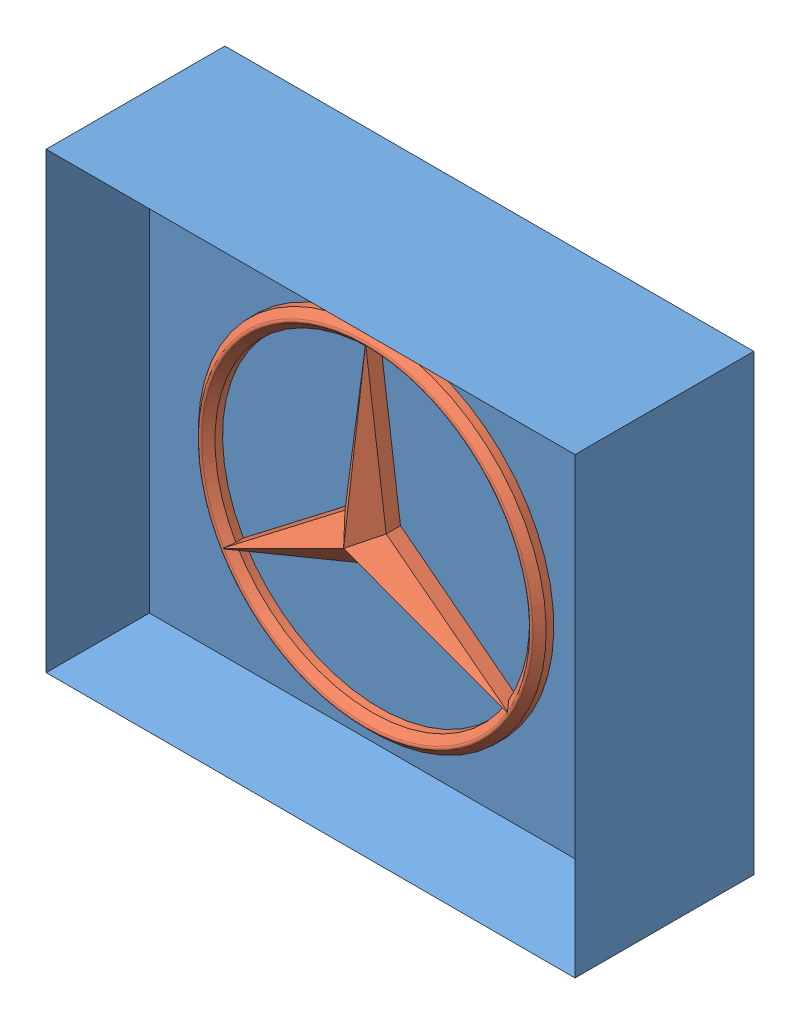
SolidWorks assembly moldassembly.SLDASM, configuration Default (file format 9000). Lengths in mm.
Overall size (88.9 76.2 30.05).
2 component instances, 2 part files, 1 mates.
Components (placement in the parent):
- box-1: box.SLDPRT [Default] at origin size (88.9 76.2 30.05)
- mercedes - Copy-1: mercedes - Copy.SLDPRT [Default] at (0.6414 -4.9482 -0.3731) size (58.49 58.49 6.1)
Mates (geometry in assembly coordinates):
- Coincident1: coincident: plane of box-1 through (0 0 0) normal (0 0 1); point of mercedes - Copy-1
